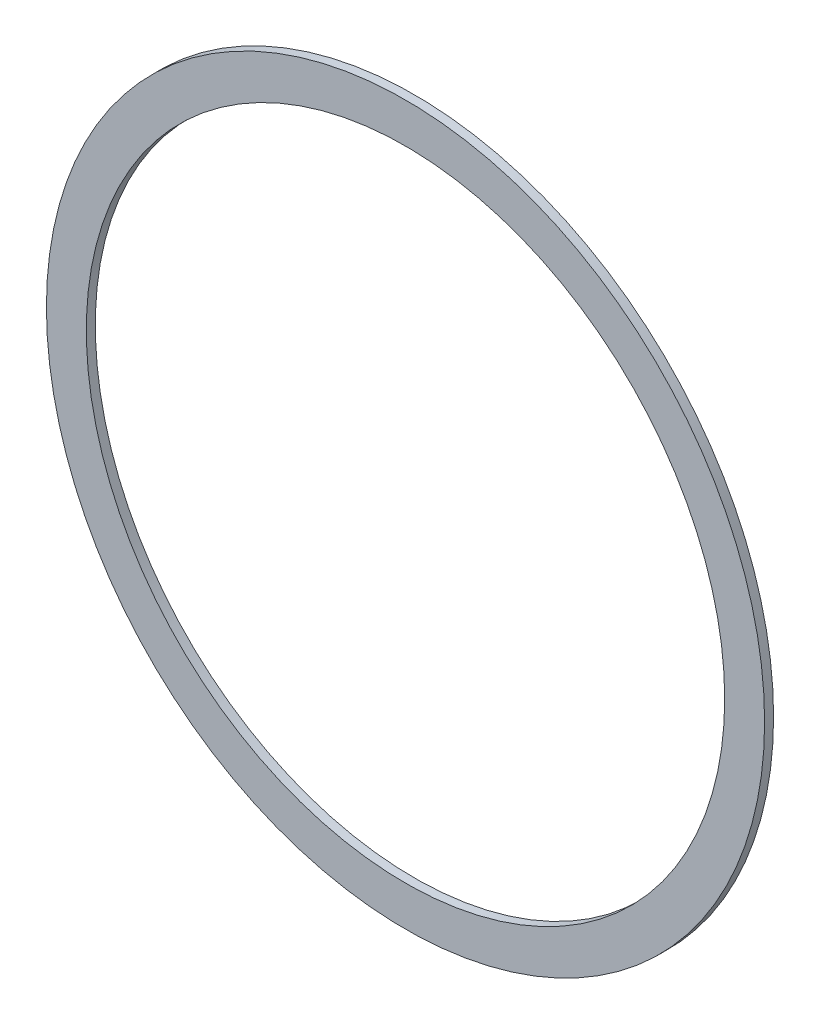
from build123d import *

# Parameters (mm, degrees)
SKETCH1_R          = 457.2
BASE_EXTRUDE_DEPTH = 11.43
SKETCH2_R          = 406.4
CUT_EXTRUDE1_DEPTH = 647.679460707


with BuildPart() as part:
    # Sketch1 → Base-Extrude (new body)
    with BuildSketch(Plane.XY):
        Circle(SKETCH1_R)
    extrude(amount=BASE_EXTRUDE_DEPTH)

    # Sketch2 → Cut-Extrude1 (cut, through all)
    with BuildSketch(Plane.XY.offset(11.43)):
        Circle(SKETCH2_R)
    extrude(amount=-CUT_EXTRUDE1_DEPTH, mode=Mode.SUBTRACT)


solid = part.part
